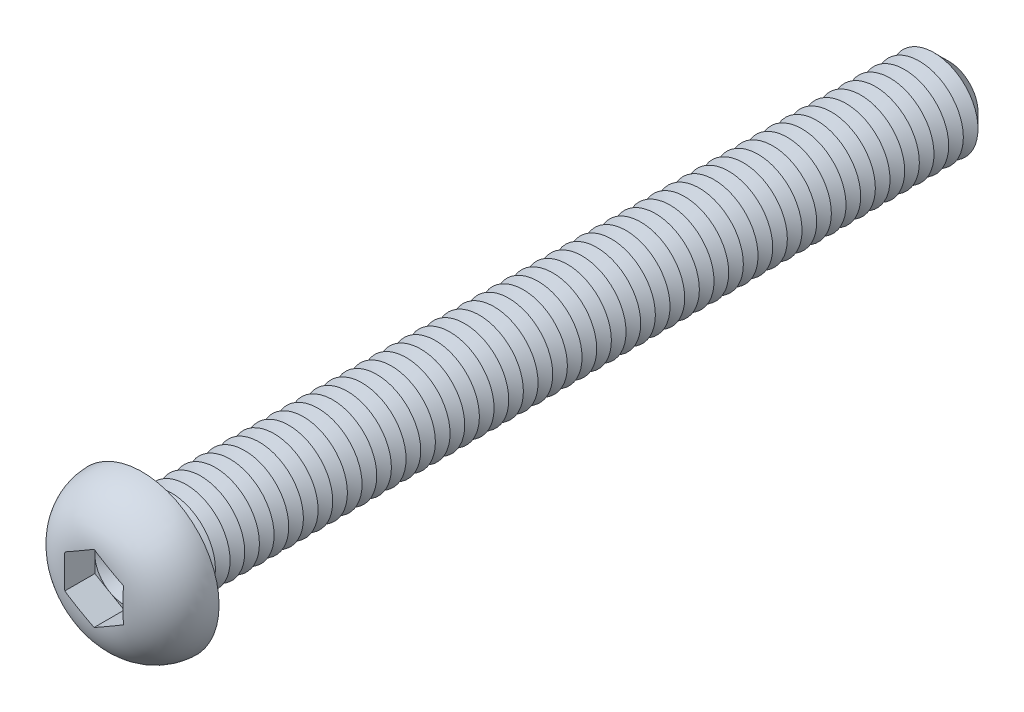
from build123d import *

# Parameters (mm, degrees)
CUT_EXTRUDE1_DEPTH  = 2.08
SKETCH4_R           = 3
BOSS_EXTRUDE1_DEPTH = 55
CHAMFER1_SIZE       = 1
LPATTERN1_COUNT     = 53
LPATTERN1_PITCH     = 1
FILLET2_R           = 0.5


with BuildPart() as part:
    # Sketch2 → Revolve1 (revolve)
    with BuildSketch(Plane(origin=(0, 0, 0), x_dir=(0, 0, -1), z_dir=(1, 0, 0)), mode=Mode.PRIVATE) as revolve1_sk:
        with BuildLine():
            Line((0, 0), (-3.3, 0))
            Line((-3.3, 0), (-3.3, 1.851470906))
            ThreePointArc((-3.3, 1.851470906), (-2.339262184, 4.220014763), (0, 5.25))
            Line((0, 5.25), (0, 0))
        make_face()
    revolve(revolve1_sk.sketch.rotate(Axis((0, 0, 47.934239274), (0, 0, -1)), 90), axis=Axis((0, 0, 47.934239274), (0, 0, -1)))

    # Sketch3 → Cut-Extrude1 (cut)
    with BuildSketch(Plane.XY.offset(3.3)):
        Polygon((0, 2.309401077), (-2, 1.154700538), (-2, -1.154700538), (0, -2.309401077), (2, -1.154700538), (2, 1.154700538), align=None)
    extrude(amount=-CUT_EXTRUDE1_DEPTH, mode=Mode.SUBTRACT)

    # Sketch4 → Boss-Extrude1 (add)
    with BuildSketch(Plane(origin=(0, 0, 0), x_dir=(-1, 0, 0), z_dir=(0, 0, -1))):
        Circle(SKETCH4_R)
    extrude(amount=BOSS_EXTRUDE1_DEPTH)

    # Chamfer1
    chamfer1_edges = [part.edges().sort_by_distance(p)[0] for p in [
        (3, 0, -55),
    ]]
    chamfer(chamfer1_edges, length=CHAMFER1_SIZE)

    # Sketch5 → Cut-Revolve1 (revolve, cut)
    with BuildSketch(Plane(origin=(0, 0, 0), x_dir=(0, 0, -1), z_dir=(1, 0, 0)), mode=Mode.PRIVATE) as cut_revolve1_sk:
        Polygon((1, 3), (2, 3), (1.5, 2.133974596), align=None)
    cut_revolve1 = revolve(cut_revolve1_sk.sketch.rotate(Axis((0, 0, 47.934239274), (0, 0, -1)), 90), axis=Axis((0, 0, 47.934239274), (0, 0, -1)), mode=Mode.SUBTRACT)

    # LPattern1: Cut-Revolve1 ×53
    with Locations(*[(0, 0, -i * LPATTERN1_PITCH) for i in range(1, LPATTERN1_COUNT)]):
        add(cut_revolve1, mode=Mode.SUBTRACT)

    # Fillet2
    fillet2_edges = [part.edges().sort_by_distance(p)[0] for p in [
        (3, 0, 0),
    ]]
    fillet(fillet2_edges, radius=FILLET2_R)

    # Cut-Extrude2 cone 1 section (on through the dimple's axis) → Cut-Extrude2 (revolve, cut)
    with BuildSketch(Plane(origin=(0, 0, 1.22), x_dir=(0, -1, 0), z_dir=(1, 0, 0))):
        Polygon((0, 0), (2, 0), (0, 1.154700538), align=None)
    revolve(axis=Axis((0, 0, 1.22), (0, 0, -1)), mode=Mode.SUBTRACT)


solid = part.part
